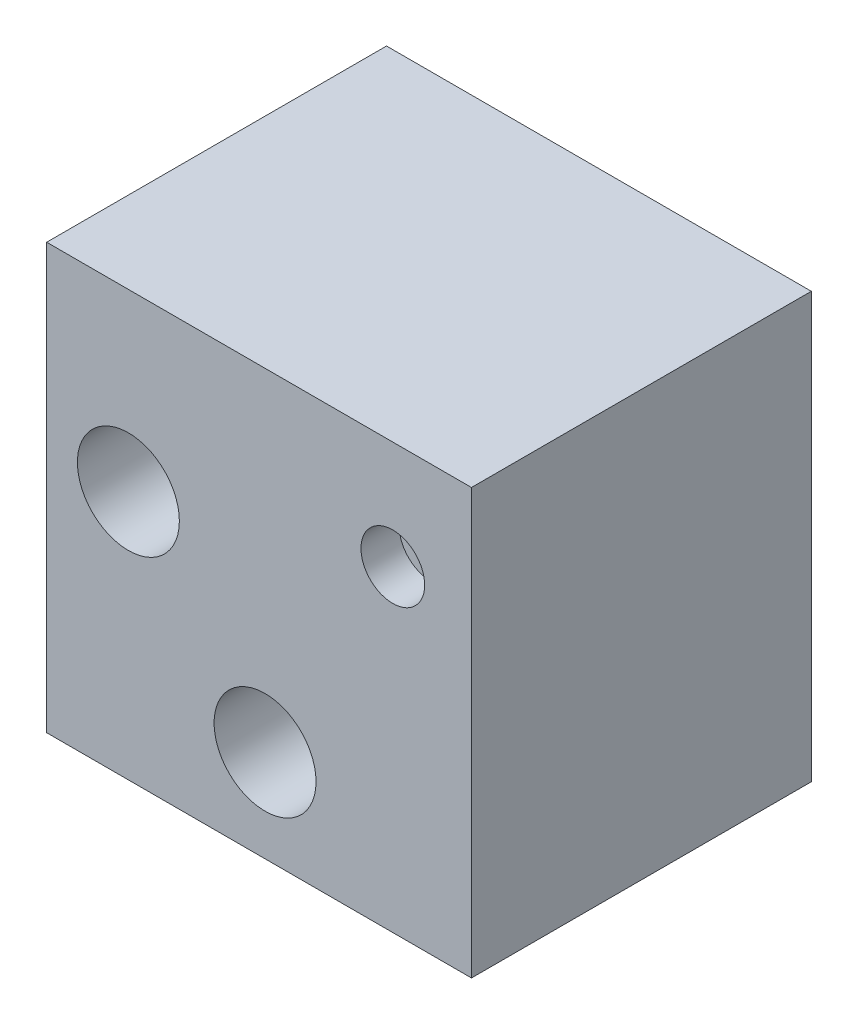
from build123d import *

# Parameters (mm, degrees)
SKICA1_W                = 100
SKICA1_H                = 100
P_IDAT_VYSUNUT_M1_DEPTH = 80
D_RA1_AT_2_COUNT        = 2
D_RA1_AT_2_PITCH        = 49.079888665
D_RA2_D                 = 8.4
D_RA2_CBORE_D           = 15
D_RA2_CBORE_DEPTH       = 9


with BuildPart() as part:
    # Skica1 → P_idat vysunut_m1 (new body)
    with BuildSketch(Plane.XY):
        with Locations((50, 50)):
            Rectangle(SKICA1_W, SKICA1_H)
    extrude(amount=P_IDAT_VYSUNUT_M1_DEPTH)

    # Skica2 → D_ra1 (revolve, cut)
    with BuildSketch(Plane(origin=(19.236088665, 58.767057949, 80), x_dir=(0, -1, 0), z_dir=(1, 0, 0))):
        Polygon((0, 0), (0, 63.004303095), (5, 60), (5, 35), (6.2, 35), (6.2, 20), (12, 20), (12, 0), align=None)
    d_ra1 = revolve(axis=Axis((19.236088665, 58.767057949, 91.310875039), (0, 0, -1)), mode=Mode.SUBTRACT)

    # D_ra1 at 2: D_ra1 ×2
    with Locations(*[Vector(0.6555649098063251, -0.7551388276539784, 0) * (i * D_RA1_AT_2_PITCH) for i in range(1, D_RA1_AT_2_COUNT)]):
        add(d_ra1, mode=Mode.SUBTRACT)

    # D_ra2 (through all)
    with Locations(Plane.XY.offset(80)):
        with Locations((81.479946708, 74.586883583)):
            CounterBoreHole(D_RA2_D / 2, D_RA2_CBORE_D / 2, D_RA2_CBORE_DEPTH)


solid = part.part
